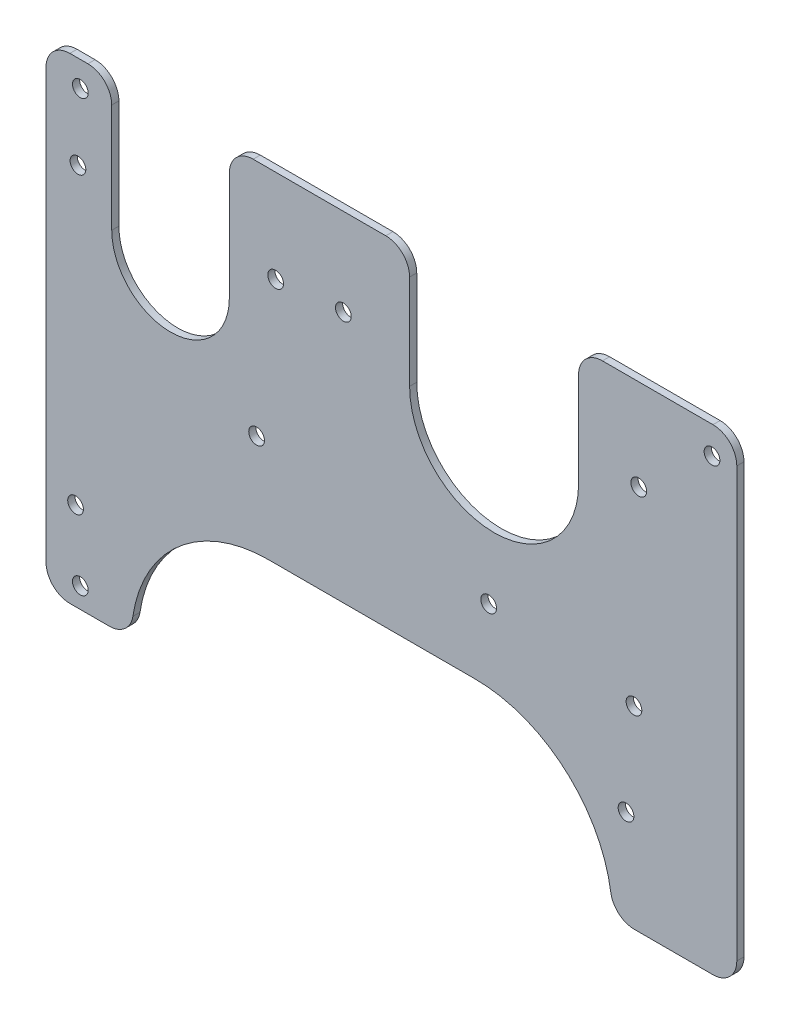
ISO-10303-21;
HEADER;
FILE_DESCRIPTION(('STEP AP214'),'2;1');
FILE_NAME('part.step','',(''),(''),'','','');
FILE_SCHEMA(('AUTOMOTIVE_DESIGN { 1 0 10303 214 1 1 1 1 }'));
ENDSEC;
DATA;
#1=APPLICATION_CONTEXT('core data for automotive mechanical design processes');
#2=APPLICATION_PROTOCOL_DEFINITION('international standard','automotive_design',2000,#1);
#3=PRODUCT_CONTEXT('',#1,'mechanical');
#4=PRODUCT('Part','Part','',(#3));
#5=PRODUCT_RELATED_PRODUCT_CATEGORY('part','',(#4));
#6=PRODUCT_DEFINITION_FORMATION('','',#4);
#7=PRODUCT_DEFINITION_CONTEXT('part definition',#1,'design');
#8=PRODUCT_DEFINITION('design','',#6,#7);
#9=PRODUCT_DEFINITION_SHAPE('','',#8);
#10=(LENGTH_UNIT() NAMED_UNIT(*) SI_UNIT(.MILLI.,.METRE.));
#11=(NAMED_UNIT(*) PLANE_ANGLE_UNIT() SI_UNIT($,.RADIAN.));
#12=(NAMED_UNIT(*) SI_UNIT($,.STERADIAN.) SOLID_ANGLE_UNIT());
#13=UNCERTAINTY_MEASURE_WITH_UNIT(LENGTH_MEASURE(1.E-05),#10,'distance_accuracy_value','');
#14=(GEOMETRIC_REPRESENTATION_CONTEXT(3) GLOBAL_UNCERTAINTY_ASSIGNED_CONTEXT((#13)) GLOBAL_UNIT_ASSIGNED_CONTEXT((#10,
#11,#12)) REPRESENTATION_CONTEXT('',''));
#15=CARTESIAN_POINT('',(0.,0.,0.));
#16=DIRECTION('',(0.,0.,1.));
#17=DIRECTION('',(1.,0.,0.));
#18=AXIS2_PLACEMENT_3D('',#15,#16,#17);
#19=CARTESIAN_POINT('',(-30.5832198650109,-25.4090195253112,1.5));
#20=DIRECTION('',(0.,1.,0.));
#21=DIRECTION('',(0.,0.,1.));
#22=AXIS2_PLACEMENT_3D('',#19,#20,#21);
#23=PLANE('',#22);
#24=DIRECTION('',(1.,0.,0.));
#25=VECTOR('',#24,1.);
#26=CARTESIAN_POINT('',(-30.5832198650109,-25.4090195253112,1.5));
#27=LINE('',#26,#25);
#28=CARTESIAN_POINT('',(-25.5832198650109,-25.4090195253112,1.5));
#29=VERTEX_POINT('',#28);
#30=CARTESIAN_POINT('',(-17.3053081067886,-25.4090195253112,1.5));
#31=VERTEX_POINT('',#30);
#32=EDGE_CURVE('E366',#29,#31,#27,.T.);
#33=ORIENTED_EDGE('',*,*,#32,.F.);
#34=DIRECTION('',(0.,0.,-1.));
#35=VECTOR('',#34,1.);
#36=CARTESIAN_POINT('',(-25.5832198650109,-25.4090195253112,1.5));
#37=LINE('',#36,#35);
#38=CARTESIAN_POINT('',(-25.5832198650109,-25.4090195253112,0.));
#39=VERTEX_POINT('',#38);
#40=EDGE_CURVE('E391',#29,#39,#37,.T.);
#41=ORIENTED_EDGE('',*,*,#40,.T.);
#42=DIRECTION('',(1.,0.,0.));
#43=VECTOR('',#42,1.);
#44=CARTESIAN_POINT('',(-30.5832198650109,-25.4090195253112,0.));
#45=LINE('',#44,#43);
#46=CARTESIAN_POINT('',(-17.3053081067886,-25.4090195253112,0.));
#47=VERTEX_POINT('',#46);
#48=EDGE_CURVE('E379',#39,#47,#45,.T.);
#49=ORIENTED_EDGE('',*,*,#48,.T.);
#50=DIRECTION('',(0.,0.,1.));
#51=VECTOR('',#50,1.);
#52=CARTESIAN_POINT('',(-17.3053081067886,-25.4090195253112,1.5));
#53=LINE('',#52,#51);
#54=EDGE_CURVE('E388',#47,#31,#53,.T.);
#55=ORIENTED_EDGE('',*,*,#54,.T.);
#56=EDGE_LOOP('',(#33,#41,#49,#55));
#57=FACE_BOUND('',#56,.T.);
#58=ADVANCED_FACE('F38',(#57),#23,.F.);
#59=CARTESIAN_POINT('',(-30.5832198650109,74.5909804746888,1.5));
#60=DIRECTION('',(0.,-1.,0.));
#61=DIRECTION('',(0.,0.,-1.));
#62=AXIS2_PLACEMENT_3D('',#59,#60,#61);
#63=PLANE('',#62);
#64=DIRECTION('',(-1.,0.,0.));
#65=VECTOR('',#64,1.);
#66=CARTESIAN_POINT('',(-30.5832198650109,74.5909804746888,1.5));
#67=LINE('',#66,#65);
#68=CARTESIAN_POINT('',(40.7330573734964,74.5909804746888,1.5));
#69=VERTEX_POINT('',#68);
#70=CARTESIAN_POINT('',(12.8917384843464,74.5909804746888,1.5));
#71=VERTEX_POINT('',#70);
#72=EDGE_CURVE('E372',#69,#71,#67,.T.);
#73=ORIENTED_EDGE('',*,*,#72,.F.);
#74=DIRECTION('',(0.,0.,1.));
#75=VECTOR('',#74,1.);
#76=CARTESIAN_POINT('',(40.7330573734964,74.5909804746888,1.5));
#77=LINE('',#76,#75);
#78=CARTESIAN_POINT('',(40.7330573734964,74.5909804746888,0.));
#79=VERTEX_POINT('',#78);
#80=EDGE_CURVE('E465',#69,#79,#77,.F.);
#81=ORIENTED_EDGE('',*,*,#80,.T.);
#82=DIRECTION('',(-1.,0.,0.));
#83=VECTOR('',#82,1.);
#84=CARTESIAN_POINT('',(-30.5832198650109,74.5909804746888,0.));
#85=LINE('',#84,#83);
#86=CARTESIAN_POINT('',(12.8917384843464,74.5909804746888,0.));
#87=VERTEX_POINT('',#86);
#88=EDGE_CURVE('E386',#79,#87,#85,.T.);
#89=ORIENTED_EDGE('',*,*,#88,.T.);
#90=DIRECTION('',(0.,0.,1.));
#91=VECTOR('',#90,1.);
#92=CARTESIAN_POINT('',(12.8917384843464,74.5909804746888,1.5));
#93=LINE('',#92,#91);
#94=EDGE_CURVE('E462',#87,#71,#93,.T.);
#95=ORIENTED_EDGE('',*,*,#94,.T.);
#96=EDGE_LOOP('',(#73,#81,#89,#95));
#97=FACE_BOUND('',#96,.T.);
#98=ADVANCED_FACE('F522',(#97),#63,.F.);
#99=CARTESIAN_POINT('',(-21.7917392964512,74.5909804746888,1.5));
#100=VERTEX_POINT('',#99);
#101=CARTESIAN_POINT('',(-25.5832198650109,74.5909804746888,1.5));
#102=VERTEX_POINT('',#101);
#103=EDGE_CURVE('E370',#100,#102,#67,.T.);
#104=ORIENTED_EDGE('',*,*,#103,.F.);
#105=DIRECTION('',(0.,0.,1.));
#106=VECTOR('',#105,1.);
#107=CARTESIAN_POINT('',(-21.7917392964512,74.5909804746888,1.5));
#108=LINE('',#107,#106);
#109=CARTESIAN_POINT('',(-21.7917392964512,74.5909804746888,0.));
#110=VERTEX_POINT('',#109);
#111=EDGE_CURVE('E11',#100,#110,#108,.F.);
#112=ORIENTED_EDGE('',*,*,#111,.T.);
#113=CARTESIAN_POINT('',(-25.5832198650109,74.5909804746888,0.));
#114=VERTEX_POINT('',#113);
#115=EDGE_CURVE('E383',#110,#114,#85,.T.);
#116=ORIENTED_EDGE('',*,*,#115,.T.);
#117=DIRECTION('',(0.,0.,-1.));
#118=VECTOR('',#117,1.);
#119=CARTESIAN_POINT('',(-25.5832198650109,74.5909804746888,1.5));
#120=LINE('',#119,#118);
#121=EDGE_CURVE('E46',#114,#102,#120,.F.);
#122=ORIENTED_EDGE('',*,*,#121,.T.);
#123=EDGE_LOOP('',(#104,#112,#116,#122));
#124=FACE_BOUND('',#123,.T.);
#125=ADVANCED_FACE('F490',(#124),#63,.F.);
#126=CARTESIAN_POINT('',(-30.5832198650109,74.5909804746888,1.5));
#127=DIRECTION('',(1.,0.,0.));
#128=DIRECTION('',(0.,1.,0.));
#129=AXIS2_PLACEMENT_3D('',#126,#127,#128);
#130=PLANE('',#129);
#131=DIRECTION('',(0.,-1.,0.));
#132=VECTOR('',#131,1.);
#133=CARTESIAN_POINT('',(-30.5832198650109,74.5909804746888,0.));
#134=LINE('',#133,#132);
#135=CARTESIAN_POINT('',(-30.5832198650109,69.5909804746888,0.));
#136=VERTEX_POINT('',#135);
#137=CARTESIAN_POINT('',(-30.5832198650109,-20.4090195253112,0.));
#138=VERTEX_POINT('',#137);
#139=EDGE_CURVE('E356',#136,#138,#134,.T.);
#140=ORIENTED_EDGE('',*,*,#139,.T.);
#141=DIRECTION('',(0.,0.,-1.));
#142=VECTOR('',#141,1.);
#143=CARTESIAN_POINT('',(-30.5832198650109,-20.4090195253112,1.5));
#144=LINE('',#143,#142);
#145=CARTESIAN_POINT('',(-30.5832198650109,-20.4090195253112,1.5));
#146=VERTEX_POINT('',#145);
#147=EDGE_CURVE('E417',#138,#146,#144,.F.);
#148=ORIENTED_EDGE('',*,*,#147,.T.);
#149=DIRECTION('',(0.,-1.,0.));
#150=VECTOR('',#149,1.);
#151=CARTESIAN_POINT('',(-30.5832198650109,74.5909804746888,1.5));
#152=LINE('',#151,#150);
#153=CARTESIAN_POINT('',(-30.5832198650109,69.5909804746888,1.5));
#154=VERTEX_POINT('',#153);
#155=EDGE_CURVE('E359',#154,#146,#152,.T.);
#156=ORIENTED_EDGE('',*,*,#155,.F.);
#157=DIRECTION('',(0.,0.,-1.));
#158=VECTOR('',#157,1.);
#159=CARTESIAN_POINT('',(-30.5832198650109,69.5909804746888,1.5));
#160=LINE('',#159,#158);
#161=EDGE_CURVE('E414',#154,#136,#160,.T.);
#162=ORIENTED_EDGE('',*,*,#161,.T.);
#163=EDGE_LOOP('',(#140,#148,#156,#162));
#164=FACE_BOUND('',#163,.T.);
#165=ADVANCED_FACE('F497',(#164),#130,.F.);
#166=CARTESIAN_POINT('',(92.9125711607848,-25.4090195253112,1.5));
#167=VERTEX_POINT('',#166);
#168=CARTESIAN_POINT('',(109.416780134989,-25.4090195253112,1.5));
#169=VERTEX_POINT('',#168);
#170=EDGE_CURVE('E362',#167,#169,#27,.T.);
#171=ORIENTED_EDGE('',*,*,#170,.F.);
#172=DIRECTION('',(0.,0.,1.));
#173=VECTOR('',#172,1.);
#174=CARTESIAN_POINT('',(92.9125711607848,-25.4090195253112,1.5));
#175=LINE('',#174,#173);
#176=CARTESIAN_POINT('',(92.9125711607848,-25.4090195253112,0.));
#177=VERTEX_POINT('',#176);
#178=EDGE_CURVE('E441',#167,#177,#175,.F.);
#179=ORIENTED_EDGE('',*,*,#178,.T.);
#180=CARTESIAN_POINT('',(109.416780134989,-25.4090195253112,0.));
#181=VERTEX_POINT('',#180);
#182=EDGE_CURVE('E376',#177,#181,#45,.T.);
#183=ORIENTED_EDGE('',*,*,#182,.T.);
#184=DIRECTION('',(0.,0.,-1.));
#185=VECTOR('',#184,1.);
#186=CARTESIAN_POINT('',(109.416780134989,-25.4090195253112,1.5));
#187=LINE('',#186,#185);
#188=EDGE_CURVE('E439',#181,#169,#187,.F.);
#189=ORIENTED_EDGE('',*,*,#188,.T.);
#190=EDGE_LOOP('',(#171,#179,#183,#189));
#191=FACE_BOUND('',#190,.T.);
#192=ADVANCED_FACE('F524',(#191),#23,.F.);
#193=CARTESIAN_POINT('',(114.416780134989,74.5909804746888,1.5));
#194=DIRECTION('',(-1.,0.,0.));
#195=DIRECTION('',(0.,-1.,0.));
#196=AXIS2_PLACEMENT_3D('',#193,#194,#195);
#197=PLANE('',#196);
#198=DIRECTION('',(0.,1.,0.));
#199=VECTOR('',#198,1.);
#200=CARTESIAN_POINT('',(114.416780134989,74.5909804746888,1.5));
#201=LINE('',#200,#199);
#202=CARTESIAN_POINT('',(114.416780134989,-20.4090195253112,1.5));
#203=VERTEX_POINT('',#202);
#204=CARTESIAN_POINT('',(114.416780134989,69.5909804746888,1.5));
#205=VERTEX_POINT('',#204);
#206=EDGE_CURVE('E367',#203,#205,#201,.T.);
#207=ORIENTED_EDGE('',*,*,#206,.F.);
#208=DIRECTION('',(0.,0.,-1.));
#209=VECTOR('',#208,1.);
#210=CARTESIAN_POINT('',(114.416780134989,-20.4090195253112,1.5));
#211=LINE('',#210,#209);
#212=CARTESIAN_POINT('',(114.416780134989,-20.4090195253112,0.));
#213=VERTEX_POINT('',#212);
#214=EDGE_CURVE('E448',#203,#213,#211,.T.);
#215=ORIENTED_EDGE('',*,*,#214,.T.);
#216=DIRECTION('',(0.,1.,0.));
#217=VECTOR('',#216,1.);
#218=CARTESIAN_POINT('',(114.416780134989,74.5909804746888,0.));
#219=LINE('',#218,#217);
#220=CARTESIAN_POINT('',(114.416780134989,69.5909804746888,0.));
#221=VERTEX_POINT('',#220);
#222=EDGE_CURVE('E380',#213,#221,#219,.T.);
#223=ORIENTED_EDGE('',*,*,#222,.T.);
#224=DIRECTION('',(0.,0.,-1.));
#225=VECTOR('',#224,1.);
#226=CARTESIAN_POINT('',(114.416780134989,69.5909804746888,1.5));
#227=LINE('',#226,#225);
#228=EDGE_CURVE('E446',#221,#205,#227,.F.);
#229=ORIENTED_EDGE('',*,*,#228,.T.);
#230=EDGE_LOOP('',(#207,#215,#223,#229));
#231=FACE_BOUND('',#230,.T.);
#232=ADVANCED_FACE('F534',(#231),#197,.F.);
#233=CARTESIAN_POINT('',(109.416780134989,74.5909804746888,1.5));
#234=VERTEX_POINT('',#233);
#235=CARTESIAN_POINT('',(86.2053269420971,74.5909804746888,1.5));
#236=VERTEX_POINT('',#235);
#237=EDGE_CURVE('E373',#234,#236,#67,.T.);
#238=ORIENTED_EDGE('',*,*,#237,.F.);
#239=DIRECTION('',(0.,0.,-1.));
#240=VECTOR('',#239,1.);
#241=CARTESIAN_POINT('',(109.416780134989,74.5909804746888,1.5));
#242=LINE('',#241,#240);
#243=CARTESIAN_POINT('',(109.416780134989,74.5909804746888,0.));
#244=VERTEX_POINT('',#243);
#245=EDGE_CURVE('E454',#234,#244,#242,.T.);
#246=ORIENTED_EDGE('',*,*,#245,.T.);
#247=CARTESIAN_POINT('',(86.2053269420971,74.5909804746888,0.));
#248=VERTEX_POINT('',#247);
#249=EDGE_CURVE('E363',#244,#248,#85,.T.);
#250=ORIENTED_EDGE('',*,*,#249,.T.);
#251=DIRECTION('',(0.,0.,1.));
#252=VECTOR('',#251,1.);
#253=CARTESIAN_POINT('',(86.2053269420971,74.5909804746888,1.5));
#254=LINE('',#253,#252);
#255=EDGE_CURVE('E451',#248,#236,#254,.T.);
#256=ORIENTED_EDGE('',*,*,#255,.T.);
#257=EDGE_LOOP('',(#238,#246,#250,#256));
#258=FACE_BOUND('',#257,.T.);
#259=ADVANCED_FACE('F530',(#258),#63,.F.);
#260=CARTESIAN_POINT('',(0.,0.,1.5));
#261=DIRECTION('',(0.,0.,1.));
#262=DIRECTION('',(1.,0.,0.));
#263=AXIS2_PLACEMENT_3D('',#260,#261,#262);
#264=PLANE('',#263);
#265=ORIENTED_EDGE('',*,*,#155,.T.);
#266=CARTESIAN_POINT('',(-25.5832198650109,-20.4090195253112,1.5));
#267=DIRECTION('',(0.,0.,1.));
#268=DIRECTION('',(1.,0.,0.));
#269=AXIS2_PLACEMENT_3D('',#266,#267,#268);
#270=CIRCLE('',#269,5.);
#271=EDGE_CURVE('E436',#146,#29,#270,.T.);
#272=ORIENTED_EDGE('',*,*,#271,.T.);
#273=ORIENTED_EDGE('',*,*,#32,.T.);
#274=CARTESIAN_POINT('',(-17.3053081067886,-20.4090195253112,1.5));
#275=DIRECTION('',(0.,0.,1.));
#276=DIRECTION('',(1.,0.,0.));
#277=AXIS2_PLACEMENT_3D('',#274,#275,#276);
#278=CIRCLE('',#277,5.);
#279=CARTESIAN_POINT('',(-12.3602982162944,-21.1485309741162,1.5));
#280=VERTEX_POINT('',#279);
#281=EDGE_CURVE('E434',#31,#280,#278,.T.);
#282=ORIENTED_EDGE('',*,*,#281,.T.);
#283=CARTESIAN_POINT('',(16.1289943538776,-25.4090195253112,1.5));
#284=DIRECTION('',(0.,0.,1.));
#285=DIRECTION('',(1.,0.,0.));
#286=AXIS2_PLACEMENT_3D('',#283,#284,#285);
#287=CIRCLE('',#286,28.8061027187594);
#288=CARTESIAN_POINT('',(16.1289943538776,3.39708319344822,1.5));
#289=VERTEX_POINT('',#288);
#290=EDGE_CURVE('E240',#289,#280,#287,.T.);
#291=ORIENTED_EDGE('',*,*,#290,.F.);
#292=DIRECTION('',(-1.,0.,0.));
#293=VECTOR('',#292,1.);
#294=CARTESIAN_POINT('',(16.1289943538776,3.39708319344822,1.5));
#295=LINE('',#294,#293);
#296=CARTESIAN_POINT('',(59.4782687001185,3.39708319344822,1.5));
#297=VERTEX_POINT('',#296);
#298=EDGE_CURVE('E218',#297,#289,#295,.T.);
#299=ORIENTED_EDGE('',*,*,#298,.F.);
#300=CARTESIAN_POINT('',(59.4782687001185,-25.4090195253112,1.5));
#301=DIRECTION('',(0.,0.,1.));
#302=DIRECTION('',(1.,0.,0.));
#303=AXIS2_PLACEMENT_3D('',#300,#301,#302);
#304=CIRCLE('',#303,28.8061027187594);
#305=CARTESIAN_POINT('',(87.9675612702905,-21.1485309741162,1.5));
#306=VERTEX_POINT('',#305);
#307=EDGE_CURVE('E242',#306,#297,#304,.T.);
#308=ORIENTED_EDGE('',*,*,#307,.F.);
#309=CARTESIAN_POINT('',(92.9125711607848,-20.4090195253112,1.5));
#310=DIRECTION('',(0.,0.,1.));
#311=DIRECTION('',(1.,0.,0.));
#312=AXIS2_PLACEMENT_3D('',#309,#310,#311);
#313=CIRCLE('',#312,5.);
#314=EDGE_CURVE('E432',#306,#167,#313,.T.);
#315=ORIENTED_EDGE('',*,*,#314,.T.);
#316=ORIENTED_EDGE('',*,*,#170,.T.);
#317=CARTESIAN_POINT('',(109.416780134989,-20.4090195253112,1.5));
#318=DIRECTION('',(0.,0.,1.));
#319=DIRECTION('',(1.,0.,0.));
#320=AXIS2_PLACEMENT_3D('',#317,#318,#319);
#321=CIRCLE('',#320,5.);
#322=EDGE_CURVE('E430',#169,#203,#321,.T.);
#323=ORIENTED_EDGE('',*,*,#322,.T.);
#324=ORIENTED_EDGE('',*,*,#206,.T.);
#325=CARTESIAN_POINT('',(109.416780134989,69.5909804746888,1.5));
#326=DIRECTION('',(0.,0.,1.));
#327=DIRECTION('',(1.,0.,0.));
#328=AXIS2_PLACEMENT_3D('',#325,#326,#327);
#329=CIRCLE('',#328,5.);
#330=EDGE_CURVE('E428',#205,#234,#329,.T.);
#331=ORIENTED_EDGE('',*,*,#330,.T.);
#332=ORIENTED_EDGE('',*,*,#237,.T.);
#333=CARTESIAN_POINT('',(86.2053269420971,69.5909804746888,1.5));
#334=DIRECTION('',(0.,0.,1.));
#335=DIRECTION('',(1.,0.,0.));
#336=AXIS2_PLACEMENT_3D('',#333,#334,#335);
#337=CIRCLE('',#336,5.);
#338=CARTESIAN_POINT('',(81.2053269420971,69.5909804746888,1.5));
#339=VERTEX_POINT('',#338);
#340=EDGE_CURVE('E426',#236,#339,#337,.T.);
#341=ORIENTED_EDGE('',*,*,#340,.T.);
#342=DIRECTION('',(0.,1.,0.));
#343=VECTOR('',#342,1.);
#344=CARTESIAN_POINT('',(81.2053269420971,49.7198506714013,1.5));
#345=LINE('',#344,#343);
#346=CARTESIAN_POINT('',(81.2053269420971,49.7198506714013,1.5));
#347=VERTEX_POINT('',#346);
#348=EDGE_CURVE('E257',#347,#339,#345,.T.);
#349=ORIENTED_EDGE('',*,*,#348,.F.);
#350=CARTESIAN_POINT('',(63.4691921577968,49.7198506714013,1.5));
#351=DIRECTION('',(0.,0.,1.));
#352=DIRECTION('',(1.,0.,0.));
#353=AXIS2_PLACEMENT_3D('',#350,#351,#352);
#354=CIRCLE('',#353,17.7361347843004);
#355=CARTESIAN_POINT('',(45.7330573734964,49.7198506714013,1.5));
#356=VERTEX_POINT('',#355);
#357=EDGE_CURVE('E222',#356,#347,#354,.T.);
#358=ORIENTED_EDGE('',*,*,#357,.F.);
#359=DIRECTION('',(0.,-1.,0.));
#360=VECTOR('',#359,1.);
#361=CARTESIAN_POINT('',(45.7330573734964,49.7198506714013,1.5));
#362=LINE('',#361,#360);
#363=CARTESIAN_POINT('',(45.7330573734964,69.5909804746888,1.5));
#364=VERTEX_POINT('',#363);
#365=EDGE_CURVE('E249',#364,#356,#362,.T.);
#366=ORIENTED_EDGE('',*,*,#365,.F.);
#367=CARTESIAN_POINT('',(40.7330573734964,69.5909804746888,1.5));
#368=DIRECTION('',(0.,0.,1.));
#369=DIRECTION('',(1.,0.,0.));
#370=AXIS2_PLACEMENT_3D('',#367,#368,#369);
#371=CIRCLE('',#370,5.);
#372=EDGE_CURVE('E424',#364,#69,#371,.T.);
#373=ORIENTED_EDGE('',*,*,#372,.T.);
#374=ORIENTED_EDGE('',*,*,#72,.T.);
#375=CARTESIAN_POINT('',(12.8917384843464,69.5909804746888,1.5));
#376=DIRECTION('',(0.,0.,1.));
#377=DIRECTION('',(1.,0.,0.));
#378=AXIS2_PLACEMENT_3D('',#375,#376,#377);
#379=CIRCLE('',#378,5.);
#380=CARTESIAN_POINT('',(7.89173848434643,69.5909804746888,1.5));
#381=VERTEX_POINT('',#380);
#382=EDGE_CURVE('E422',#71,#381,#379,.T.);
#383=ORIENTED_EDGE('',*,*,#382,.T.);
#384=DIRECTION('',(0.,1.,0.));
#385=VECTOR('',#384,1.);
#386=CARTESIAN_POINT('',(7.89173848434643,46.8277647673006,1.5));
#387=LINE('',#386,#385);
#388=CARTESIAN_POINT('',(7.89173848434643,46.8277647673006,1.5));
#389=VERTEX_POINT('',#388);
#390=EDGE_CURVE('E278',#389,#381,#387,.T.);
#391=ORIENTED_EDGE('',*,*,#390,.F.);
#392=CARTESIAN_POINT('',(-4.45000040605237,46.8277647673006,1.5));
#393=DIRECTION('',(0.,0.,1.));
#394=DIRECTION('',(1.,0.,0.));
#395=AXIS2_PLACEMENT_3D('',#392,#393,#394);
#396=CIRCLE('',#395,12.3417388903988);
#397=CARTESIAN_POINT('',(-16.7917392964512,46.8277647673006,1.5));
#398=VERTEX_POINT('',#397);
#399=EDGE_CURVE('E264',#398,#389,#396,.T.);
#400=ORIENTED_EDGE('',*,*,#399,.F.);
#401=DIRECTION('',(0.,-1.,0.));
#402=VECTOR('',#401,1.);
#403=CARTESIAN_POINT('',(-16.7917392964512,46.8277647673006,1.5));
#404=LINE('',#403,#402);
#405=CARTESIAN_POINT('',(-16.7917392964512,69.5909804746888,1.5));
#406=VERTEX_POINT('',#405);
#407=EDGE_CURVE('E270',#406,#398,#404,.T.);
#408=ORIENTED_EDGE('',*,*,#407,.F.);
#409=CARTESIAN_POINT('',(-21.7917392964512,69.5909804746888,1.5));
#410=DIRECTION('',(0.,0.,1.));
#411=DIRECTION('',(1.,0.,0.));
#412=AXIS2_PLACEMENT_3D('',#409,#410,#411);
#413=CIRCLE('',#412,5.);
#414=EDGE_CURVE('E59',#406,#100,#413,.T.);
#415=ORIENTED_EDGE('',*,*,#414,.T.);
#416=ORIENTED_EDGE('',*,*,#103,.T.);
#417=CARTESIAN_POINT('',(-25.5832198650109,69.5909804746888,1.5));
#418=DIRECTION('',(0.,0.,1.));
#419=DIRECTION('',(1.,0.,0.));
#420=AXIS2_PLACEMENT_3D('',#417,#418,#419);
#421=CIRCLE('',#420,5.);
#422=EDGE_CURVE('E419',#102,#154,#421,.T.);
#423=ORIENTED_EDGE('',*,*,#422,.T.);
#424=EDGE_LOOP('',(#265,#272,#273,#282,#291,#299,#308,#315,#316,#323,#324,#331,#332,#341,#349,
#358,#366,#373,#374,#383,#391,#400,#408,#415,#416,#423));
#425=FACE_BOUND('',#424,.T.);
#426=CARTESIAN_POINT('',(92.8292722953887,15.1679548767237,1.5));
#427=DIRECTION('',(0.,0.,-1.));
#428=DIRECTION('',(-1.,0.,0.));
#429=AXIS2_PLACEMENT_3D('',#426,#427,#428);
#430=CIRCLE('',#429,1.65);
#431=CARTESIAN_POINT('',(91.1792722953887,15.1679548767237,1.5));
#432=VERTEX_POINT('',#431);
#433=EDGE_CURVE('E287',#432,#432,#430,.T.);
#434=ORIENTED_EDGE('',*,*,#433,.T.);
#435=EDGE_LOOP('',(#434));
#436=FACE_BOUND('',#435,.T.);
#437=CARTESIAN_POINT('',(93.8292722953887,55.4679548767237,1.5));
#438=DIRECTION('',(0.,0.,-1.));
#439=DIRECTION('',(-1.,0.,0.));
#440=AXIS2_PLACEMENT_3D('',#437,#438,#439);
#441=CIRCLE('',#440,1.65);
#442=CARTESIAN_POINT('',(92.1792722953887,55.4679548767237,1.5));
#443=VERTEX_POINT('',#442);
#444=EDGE_CURVE('E293',#443,#443,#441,.T.);
#445=ORIENTED_EDGE('',*,*,#444,.T.);
#446=EDGE_LOOP('',(#445));
#447=FACE_BOUND('',#446,.T.);
#448=CARTESIAN_POINT('',(62.3292722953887,18.4679548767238,1.5));
#449=DIRECTION('',(0.,0.,-1.));
#450=DIRECTION('',(-1.,0.,0.));
#451=AXIS2_PLACEMENT_3D('',#448,#449,#450);
#452=CIRCLE('',#451,1.65);
#453=CARTESIAN_POINT('',(60.6792722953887,18.4679548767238,1.5));
#454=VERTEX_POINT('',#453);
#455=EDGE_CURVE('E299',#454,#454,#452,.T.);
#456=ORIENTED_EDGE('',*,*,#455,.T.);
#457=EDGE_LOOP('',(#456));
#458=FACE_BOUND('',#457,.T.);
#459=CARTESIAN_POINT('',(31.8292722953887,56.2679548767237,1.5));
#460=DIRECTION('',(0.,0.,-1.));
#461=DIRECTION('',(-1.,0.,0.));
#462=AXIS2_PLACEMENT_3D('',#459,#460,#461);
#463=CIRCLE('',#462,1.65);
#464=CARTESIAN_POINT('',(30.1792722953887,56.2679548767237,1.5));
#465=VERTEX_POINT('',#464);
#466=EDGE_CURVE('E305',#465,#465,#463,.T.);
#467=ORIENTED_EDGE('',*,*,#466,.T.);
#468=EDGE_LOOP('',(#467));
#469=FACE_BOUND('',#468,.T.);
#470=CARTESIAN_POINT('',(-24.3855963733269,-6.88312802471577,1.5));
#471=DIRECTION('',(0.,0.,-1.));
#472=DIRECTION('',(-1.,0.,0.));
#473=AXIS2_PLACEMENT_3D('',#470,#471,#472);
#474=CIRCLE('',#473,1.65);
#475=CARTESIAN_POINT('',(-26.0355963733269,-6.88312802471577,1.5));
#476=VERTEX_POINT('',#475);
#477=EDGE_CURVE('E311',#476,#476,#474,.T.);
#478=ORIENTED_EDGE('',*,*,#477,.T.);
#479=EDGE_LOOP('',(#478));
#480=FACE_BOUND('',#479,.T.);
#481=CARTESIAN_POINT('',(-23.8855963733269,55.1168719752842,1.5));
#482=DIRECTION('',(0.,0.,-1.));
#483=DIRECTION('',(-1.,0.,0.));
#484=AXIS2_PLACEMENT_3D('',#481,#482,#483);
#485=CIRCLE('',#484,1.65);
#486=CARTESIAN_POINT('',(-25.5355963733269,55.1168719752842,1.5));
#487=VERTEX_POINT('',#486);
#488=EDGE_CURVE('E317',#487,#487,#485,.T.);
#489=ORIENTED_EDGE('',*,*,#488,.T.);
#490=EDGE_LOOP('',(#489));
#491=FACE_BOUND('',#490,.T.);
#492=CARTESIAN_POINT('',(13.6144036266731,24.6168719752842,1.5));
#493=DIRECTION('',(0.,0.,-1.));
#494=DIRECTION('',(-1.,0.,0.));
#495=AXIS2_PLACEMENT_3D('',#492,#493,#494);
#496=CIRCLE('',#495,1.65);
#497=CARTESIAN_POINT('',(11.9644036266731,24.6168719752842,1.5));
#498=VERTEX_POINT('',#497);
#499=EDGE_CURVE('E323',#498,#498,#496,.T.);
#500=ORIENTED_EDGE('',*,*,#499,.T.);
#501=EDGE_LOOP('',(#500));
#502=FACE_BOUND('',#501,.T.);
#503=CARTESIAN_POINT('',(17.6144036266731,55.1168719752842,1.5));
#504=DIRECTION('',(0.,0.,-1.));
#505=DIRECTION('',(-1.,0.,0.));
#506=AXIS2_PLACEMENT_3D('',#503,#504,#505);
#507=CIRCLE('',#506,1.65);
#508=CARTESIAN_POINT('',(15.9644036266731,55.1168719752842,1.5));
#509=VERTEX_POINT('',#508);
#510=EDGE_CURVE('E329',#509,#509,#507,.T.);
#511=ORIENTED_EDGE('',*,*,#510,.T.);
#512=EDGE_LOOP('',(#511));
#513=FACE_BOUND('',#512,.T.);
#514=CARTESIAN_POINT('',(109.21134972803,68.7909804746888,1.5));
#515=DIRECTION('',(0.,0.,-1.));
#516=DIRECTION('',(-1.,0.,0.));
#517=AXIS2_PLACEMENT_3D('',#514,#515,#516);
#518=CIRCLE('',#517,1.65);
#519=CARTESIAN_POINT('',(107.56134972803,68.7909804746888,1.5));
#520=VERTEX_POINT('',#519);
#521=EDGE_CURVE('E335',#520,#520,#518,.T.);
#522=ORIENTED_EDGE('',*,*,#521,.T.);
#523=EDGE_LOOP('',(#522));
#524=FACE_BOUND('',#523,.T.);
#525=CARTESIAN_POINT('',(91.1613497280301,-4.95901952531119,1.5));
#526=DIRECTION('',(0.,0.,-1.));
#527=DIRECTION('',(-1.,0.,0.));
#528=AXIS2_PLACEMENT_3D('',#525,#526,#527);
#529=CIRCLE('',#528,1.65);
#530=CARTESIAN_POINT('',(89.5113497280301,-4.95901952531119,1.5));
#531=VERTEX_POINT('',#530);
#532=EDGE_CURVE('E341',#531,#531,#529,.T.);
#533=ORIENTED_EDGE('',*,*,#532,.T.);
#534=EDGE_LOOP('',(#533));
#535=FACE_BOUND('',#534,.T.);
#536=CARTESIAN_POINT('',(-23.3886502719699,69.2909804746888,1.5));
#537=DIRECTION('',(0.,0.,-1.));
#538=DIRECTION('',(-1.,0.,0.));
#539=AXIS2_PLACEMENT_3D('',#536,#537,#538);
#540=CIRCLE('',#539,1.65);
#541=CARTESIAN_POINT('',(-25.0386502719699,69.2909804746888,1.5));
#542=VERTEX_POINT('',#541);
#543=EDGE_CURVE('E347',#542,#542,#540,.T.);
#544=ORIENTED_EDGE('',*,*,#543,.T.);
#545=EDGE_LOOP('',(#544));
#546=FACE_BOUND('',#545,.T.);
#547=CARTESIAN_POINT('',(-23.3886502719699,-21.1090195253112,1.5));
#548=DIRECTION('',(0.,0.,-1.));
#549=DIRECTION('',(-1.,0.,0.));
#550=AXIS2_PLACEMENT_3D('',#547,#548,#549);
#551=CIRCLE('',#550,1.65);
#552=CARTESIAN_POINT('',(-25.0386502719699,-21.1090195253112,1.5));
#553=VERTEX_POINT('',#552);
#554=EDGE_CURVE('E353',#553,#553,#551,.T.);
#555=ORIENTED_EDGE('',*,*,#554,.T.);
#556=EDGE_LOOP('',(#555));
#557=FACE_BOUND('',#556,.T.);
#558=ADVANCED_FACE('F479',(#425,#436,#447,#458,#469,#480,#491,#502,#513,#524,#535,#546,#557),
#264,.T.);
#559=CARTESIAN_POINT('',(0.,0.,0.));
#560=DIRECTION('',(0.,0.,1.));
#561=DIRECTION('',(1.,0.,0.));
#562=AXIS2_PLACEMENT_3D('',#559,#560,#561);
#563=PLANE('',#562);
#564=CARTESIAN_POINT('',(92.8292722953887,15.1679548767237,0.));
#565=DIRECTION('',(0.,0.,-1.));
#566=DIRECTION('',(-1.,0.,0.));
#567=AXIS2_PLACEMENT_3D('',#564,#565,#566);
#568=CIRCLE('',#567,1.65);
#569=CARTESIAN_POINT('',(91.1792722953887,15.1679548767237,0.));
#570=VERTEX_POINT('',#569);
#571=EDGE_CURVE('E285',#570,#570,#568,.T.);
#572=ORIENTED_EDGE('',*,*,#571,.F.);
#573=EDGE_LOOP('',(#572));
#574=FACE_BOUND('',#573,.T.);
#575=CARTESIAN_POINT('',(93.8292722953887,55.4679548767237,0.));
#576=DIRECTION('',(0.,0.,-1.));
#577=DIRECTION('',(-1.,0.,0.));
#578=AXIS2_PLACEMENT_3D('',#575,#576,#577);
#579=CIRCLE('',#578,1.65);
#580=CARTESIAN_POINT('',(92.1792722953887,55.4679548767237,0.));
#581=VERTEX_POINT('',#580);
#582=EDGE_CURVE('E290',#581,#581,#579,.T.);
#583=ORIENTED_EDGE('',*,*,#582,.F.);
#584=EDGE_LOOP('',(#583));
#585=FACE_BOUND('',#584,.T.);
#586=CARTESIAN_POINT('',(62.3292722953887,18.4679548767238,0.));
#587=DIRECTION('',(0.,0.,-1.));
#588=DIRECTION('',(-1.,0.,0.));
#589=AXIS2_PLACEMENT_3D('',#586,#587,#588);
#590=CIRCLE('',#589,1.65);
#591=CARTESIAN_POINT('',(60.6792722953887,18.4679548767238,0.));
#592=VERTEX_POINT('',#591);
#593=EDGE_CURVE('E296',#592,#592,#590,.T.);
#594=ORIENTED_EDGE('',*,*,#593,.F.);
#595=EDGE_LOOP('',(#594));
#596=FACE_BOUND('',#595,.T.);
#597=CARTESIAN_POINT('',(31.8292722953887,56.2679548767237,0.));
#598=DIRECTION('',(0.,0.,-1.));
#599=DIRECTION('',(-1.,0.,0.));
#600=AXIS2_PLACEMENT_3D('',#597,#598,#599);
#601=CIRCLE('',#600,1.65);
#602=CARTESIAN_POINT('',(30.1792722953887,56.2679548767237,0.));
#603=VERTEX_POINT('',#602);
#604=EDGE_CURVE('E302',#603,#603,#601,.T.);
#605=ORIENTED_EDGE('',*,*,#604,.F.);
#606=EDGE_LOOP('',(#605));
#607=FACE_BOUND('',#606,.T.);
#608=CARTESIAN_POINT('',(-24.3855963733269,-6.88312802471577,0.));
#609=DIRECTION('',(0.,0.,-1.));
#610=DIRECTION('',(-1.,0.,0.));
#611=AXIS2_PLACEMENT_3D('',#608,#609,#610);
#612=CIRCLE('',#611,1.65);
#613=CARTESIAN_POINT('',(-26.0355963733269,-6.88312802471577,0.));
#614=VERTEX_POINT('',#613);
#615=EDGE_CURVE('E308',#614,#614,#612,.T.);
#616=ORIENTED_EDGE('',*,*,#615,.F.);
#617=EDGE_LOOP('',(#616));
#618=FACE_BOUND('',#617,.T.);
#619=CARTESIAN_POINT('',(-23.8855963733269,55.1168719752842,0.));
#620=DIRECTION('',(0.,0.,-1.));
#621=DIRECTION('',(-1.,0.,0.));
#622=AXIS2_PLACEMENT_3D('',#619,#620,#621);
#623=CIRCLE('',#622,1.65);
#624=CARTESIAN_POINT('',(-25.5355963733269,55.1168719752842,0.));
#625=VERTEX_POINT('',#624);
#626=EDGE_CURVE('E314',#625,#625,#623,.T.);
#627=ORIENTED_EDGE('',*,*,#626,.F.);
#628=EDGE_LOOP('',(#627));
#629=FACE_BOUND('',#628,.T.);
#630=CARTESIAN_POINT('',(13.6144036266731,24.6168719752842,0.));
#631=DIRECTION('',(0.,0.,-1.));
#632=DIRECTION('',(-1.,0.,0.));
#633=AXIS2_PLACEMENT_3D('',#630,#631,#632);
#634=CIRCLE('',#633,1.65);
#635=CARTESIAN_POINT('',(11.9644036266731,24.6168719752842,0.));
#636=VERTEX_POINT('',#635);
#637=EDGE_CURVE('E320',#636,#636,#634,.T.);
#638=ORIENTED_EDGE('',*,*,#637,.F.);
#639=EDGE_LOOP('',(#638));
#640=FACE_BOUND('',#639,.T.);
#641=CARTESIAN_POINT('',(17.6144036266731,55.1168719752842,0.));
#642=DIRECTION('',(0.,0.,-1.));
#643=DIRECTION('',(-1.,0.,0.));
#644=AXIS2_PLACEMENT_3D('',#641,#642,#643);
#645=CIRCLE('',#644,1.65);
#646=CARTESIAN_POINT('',(15.9644036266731,55.1168719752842,0.));
#647=VERTEX_POINT('',#646);
#648=EDGE_CURVE('E326',#647,#647,#645,.T.);
#649=ORIENTED_EDGE('',*,*,#648,.F.);
#650=EDGE_LOOP('',(#649));
#651=FACE_BOUND('',#650,.T.);
#652=CARTESIAN_POINT('',(109.21134972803,68.7909804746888,0.));
#653=DIRECTION('',(0.,0.,-1.));
#654=DIRECTION('',(-1.,0.,0.));
#655=AXIS2_PLACEMENT_3D('',#652,#653,#654);
#656=CIRCLE('',#655,1.65);
#657=CARTESIAN_POINT('',(107.56134972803,68.7909804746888,0.));
#658=VERTEX_POINT('',#657);
#659=EDGE_CURVE('E332',#658,#658,#656,.T.);
#660=ORIENTED_EDGE('',*,*,#659,.F.);
#661=EDGE_LOOP('',(#660));
#662=FACE_BOUND('',#661,.T.);
#663=CARTESIAN_POINT('',(91.1613497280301,-4.95901952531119,0.));
#664=DIRECTION('',(0.,0.,-1.));
#665=DIRECTION('',(-1.,0.,0.));
#666=AXIS2_PLACEMENT_3D('',#663,#664,#665);
#667=CIRCLE('',#666,1.65);
#668=CARTESIAN_POINT('',(89.5113497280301,-4.95901952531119,0.));
#669=VERTEX_POINT('',#668);
#670=EDGE_CURVE('E338',#669,#669,#667,.T.);
#671=ORIENTED_EDGE('',*,*,#670,.F.);
#672=EDGE_LOOP('',(#671));
#673=FACE_BOUND('',#672,.T.);
#674=CARTESIAN_POINT('',(-23.3886502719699,69.2909804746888,0.));
#675=DIRECTION('',(0.,0.,-1.));
#676=DIRECTION('',(-1.,0.,0.));
#677=AXIS2_PLACEMENT_3D('',#674,#675,#676);
#678=CIRCLE('',#677,1.65);
#679=CARTESIAN_POINT('',(-25.0386502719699,69.2909804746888,0.));
#680=VERTEX_POINT('',#679);
#681=EDGE_CURVE('E344',#680,#680,#678,.T.);
#682=ORIENTED_EDGE('',*,*,#681,.F.);
#683=EDGE_LOOP('',(#682));
#684=FACE_BOUND('',#683,.T.);
#685=CARTESIAN_POINT('',(-23.3886502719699,-21.1090195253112,0.));
#686=DIRECTION('',(0.,0.,-1.));
#687=DIRECTION('',(-1.,0.,0.));
#688=AXIS2_PLACEMENT_3D('',#685,#686,#687);
#689=CIRCLE('',#688,1.65);
#690=CARTESIAN_POINT('',(-25.0386502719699,-21.1090195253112,0.));
#691=VERTEX_POINT('',#690);
#692=EDGE_CURVE('E350',#691,#691,#689,.T.);
#693=ORIENTED_EDGE('',*,*,#692,.F.);
#694=EDGE_LOOP('',(#693));
#695=FACE_BOUND('',#694,.T.);
#696=ORIENTED_EDGE('',*,*,#48,.F.);
#697=CARTESIAN_POINT('',(-25.5832198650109,-20.4090195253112,0.));
#698=DIRECTION('',(0.,0.,1.));
#699=DIRECTION('',(1.,0.,0.));
#700=AXIS2_PLACEMENT_3D('',#697,#698,#699);
#701=CIRCLE('',#700,5.);
#702=EDGE_CURVE('E412',#39,#138,#701,.F.);
#703=ORIENTED_EDGE('',*,*,#702,.T.);
#704=ORIENTED_EDGE('',*,*,#139,.F.);
#705=CARTESIAN_POINT('',(-25.5832198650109,69.5909804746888,0.));
#706=DIRECTION('',(0.,0.,1.));
#707=DIRECTION('',(1.,0.,0.));
#708=AXIS2_PLACEMENT_3D('',#705,#706,#707);
#709=CIRCLE('',#708,5.);
#710=EDGE_CURVE('E394',#136,#114,#709,.F.);
#711=ORIENTED_EDGE('',*,*,#710,.T.);
#712=ORIENTED_EDGE('',*,*,#115,.F.);
#713=CARTESIAN_POINT('',(-21.7917392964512,69.5909804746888,0.));
#714=DIRECTION('',(0.,0.,1.));
#715=DIRECTION('',(1.,0.,0.));
#716=AXIS2_PLACEMENT_3D('',#713,#714,#715);
#717=CIRCLE('',#716,5.);
#718=CARTESIAN_POINT('',(-16.7917392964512,69.5909804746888,0.));
#719=VERTEX_POINT('',#718);
#720=EDGE_CURVE('E396',#110,#719,#717,.F.);
#721=ORIENTED_EDGE('',*,*,#720,.T.);
#722=DIRECTION('',(0.,-1.,0.));
#723=VECTOR('',#722,1.);
#724=CARTESIAN_POINT('',(-16.7917392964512,46.8277647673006,0.));
#725=LINE('',#724,#723);
#726=CARTESIAN_POINT('',(-16.7917392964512,46.8277647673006,0.));
#727=VERTEX_POINT('',#726);
#728=EDGE_CURVE('E273',#719,#727,#725,.T.);
#729=ORIENTED_EDGE('',*,*,#728,.T.);
#730=CARTESIAN_POINT('',(-4.45000040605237,46.8277647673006,0.));
#731=DIRECTION('',(0.,0.,1.));
#732=DIRECTION('',(1.,0.,0.));
#733=AXIS2_PLACEMENT_3D('',#730,#731,#732);
#734=CIRCLE('',#733,12.3417388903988);
#735=CARTESIAN_POINT('',(7.89173848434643,46.8277647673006,0.));
#736=VERTEX_POINT('',#735);
#737=EDGE_CURVE('E266',#727,#736,#734,.T.);
#738=ORIENTED_EDGE('',*,*,#737,.T.);
#739=DIRECTION('',(0.,1.,0.));
#740=VECTOR('',#739,1.);
#741=CARTESIAN_POINT('',(7.89173848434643,46.8277647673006,0.));
#742=LINE('',#741,#740);
#743=CARTESIAN_POINT('',(7.89173848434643,69.5909804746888,0.));
#744=VERTEX_POINT('',#743);
#745=EDGE_CURVE('E269',#736,#744,#742,.T.);
#746=ORIENTED_EDGE('',*,*,#745,.T.);
#747=CARTESIAN_POINT('',(12.8917384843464,69.5909804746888,0.));
#748=DIRECTION('',(0.,0.,1.));
#749=DIRECTION('',(1.,0.,0.));
#750=AXIS2_PLACEMENT_3D('',#747,#748,#749);
#751=CIRCLE('',#750,5.);
#752=EDGE_CURVE('E398',#744,#87,#751,.F.);
#753=ORIENTED_EDGE('',*,*,#752,.T.);
#754=ORIENTED_EDGE('',*,*,#88,.F.);
#755=CARTESIAN_POINT('',(40.7330573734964,69.5909804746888,0.));
#756=DIRECTION('',(0.,0.,1.));
#757=DIRECTION('',(1.,0.,0.));
#758=AXIS2_PLACEMENT_3D('',#755,#756,#757);
#759=CIRCLE('',#758,5.);
#760=CARTESIAN_POINT('',(45.7330573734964,69.5909804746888,0.));
#761=VERTEX_POINT('',#760);
#762=EDGE_CURVE('E400',#79,#761,#759,.F.);
#763=ORIENTED_EDGE('',*,*,#762,.T.);
#764=DIRECTION('',(0.,-1.,0.));
#765=VECTOR('',#764,1.);
#766=CARTESIAN_POINT('',(45.7330573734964,49.7198506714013,0.));
#767=LINE('',#766,#765);
#768=CARTESIAN_POINT('',(45.7330573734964,49.7198506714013,0.));
#769=VERTEX_POINT('',#768);
#770=EDGE_CURVE('E252',#761,#769,#767,.T.);
#771=ORIENTED_EDGE('',*,*,#770,.T.);
#772=CARTESIAN_POINT('',(63.4691921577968,49.7198506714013,0.));
#773=DIRECTION('',(0.,0.,1.));
#774=DIRECTION('',(1.,0.,0.));
#775=AXIS2_PLACEMENT_3D('',#772,#773,#774);
#776=CIRCLE('',#775,17.7361347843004);
#777=CARTESIAN_POINT('',(81.2053269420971,49.7198506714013,0.));
#778=VERTEX_POINT('',#777);
#779=EDGE_CURVE('E245',#769,#778,#776,.T.);
#780=ORIENTED_EDGE('',*,*,#779,.T.);
#781=DIRECTION('',(0.,1.,0.));
#782=VECTOR('',#781,1.);
#783=CARTESIAN_POINT('',(81.2053269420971,49.7198506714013,0.));
#784=LINE('',#783,#782);
#785=CARTESIAN_POINT('',(81.2053269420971,69.5909804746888,0.));
#786=VERTEX_POINT('',#785);
#787=EDGE_CURVE('E248',#778,#786,#784,.T.);
#788=ORIENTED_EDGE('',*,*,#787,.T.);
#789=CARTESIAN_POINT('',(86.2053269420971,69.5909804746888,0.));
#790=DIRECTION('',(0.,0.,1.));
#791=DIRECTION('',(1.,0.,0.));
#792=AXIS2_PLACEMENT_3D('',#789,#790,#791);
#793=CIRCLE('',#792,5.);
#794=EDGE_CURVE('E402',#786,#248,#793,.F.);
#795=ORIENTED_EDGE('',*,*,#794,.T.);
#796=ORIENTED_EDGE('',*,*,#249,.F.);
#797=CARTESIAN_POINT('',(109.416780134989,69.5909804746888,0.));
#798=DIRECTION('',(0.,0.,1.));
#799=DIRECTION('',(1.,0.,0.));
#800=AXIS2_PLACEMENT_3D('',#797,#798,#799);
#801=CIRCLE('',#800,5.);
#802=EDGE_CURVE('E404',#244,#221,#801,.F.);
#803=ORIENTED_EDGE('',*,*,#802,.T.);
#804=ORIENTED_EDGE('',*,*,#222,.F.);
#805=CARTESIAN_POINT('',(109.416780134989,-20.4090195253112,0.));
#806=DIRECTION('',(0.,0.,1.));
#807=DIRECTION('',(1.,0.,0.));
#808=AXIS2_PLACEMENT_3D('',#805,#806,#807);
#809=CIRCLE('',#808,5.);
#810=EDGE_CURVE('E406',#213,#181,#809,.F.);
#811=ORIENTED_EDGE('',*,*,#810,.T.);
#812=ORIENTED_EDGE('',*,*,#182,.F.);
#813=CARTESIAN_POINT('',(92.9125711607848,-20.4090195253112,0.));
#814=DIRECTION('',(0.,0.,1.));
#815=DIRECTION('',(1.,0.,0.));
#816=AXIS2_PLACEMENT_3D('',#813,#814,#815);
#817=CIRCLE('',#816,5.);
#818=CARTESIAN_POINT('',(87.9675612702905,-21.1485309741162,0.));
#819=VERTEX_POINT('',#818);
#820=EDGE_CURVE('E408',#177,#819,#817,.F.);
#821=ORIENTED_EDGE('',*,*,#820,.T.);
#822=CARTESIAN_POINT('',(59.4782687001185,-25.4090195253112,0.));
#823=DIRECTION('',(0.,0.,1.));
#824=DIRECTION('',(1.,0.,0.));
#825=AXIS2_PLACEMENT_3D('',#822,#823,#824);
#826=CIRCLE('',#825,28.8061027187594);
#827=CARTESIAN_POINT('',(59.4782687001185,3.39708319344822,0.));
#828=VERTEX_POINT('',#827);
#829=EDGE_CURVE('E236',#819,#828,#826,.T.);
#830=ORIENTED_EDGE('',*,*,#829,.T.);
#831=DIRECTION('',(-1.,0.,0.));
#832=VECTOR('',#831,1.);
#833=CARTESIAN_POINT('',(16.1289943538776,3.39708319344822,0.));
#834=LINE('',#833,#832);
#835=CARTESIAN_POINT('',(16.1289943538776,3.39708319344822,0.));
#836=VERTEX_POINT('',#835);
#837=EDGE_CURVE('E215',#828,#836,#834,.T.);
#838=ORIENTED_EDGE('',*,*,#837,.T.);
#839=CARTESIAN_POINT('',(16.1289943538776,-25.4090195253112,0.));
#840=DIRECTION('',(0.,0.,1.));
#841=DIRECTION('',(1.,0.,0.));
#842=AXIS2_PLACEMENT_3D('',#839,#840,#841);
#843=CIRCLE('',#842,28.8061027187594);
#844=CARTESIAN_POINT('',(-12.3602982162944,-21.1485309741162,0.));
#845=VERTEX_POINT('',#844);
#846=EDGE_CURVE('E226',#836,#845,#843,.T.);
#847=ORIENTED_EDGE('',*,*,#846,.T.);
#848=CARTESIAN_POINT('',(-17.3053081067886,-20.4090195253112,0.));
#849=DIRECTION('',(0.,0.,1.));
#850=DIRECTION('',(1.,0.,0.));
#851=AXIS2_PLACEMENT_3D('',#848,#849,#850);
#852=CIRCLE('',#851,5.);
#853=EDGE_CURVE('E410',#845,#47,#852,.F.);
#854=ORIENTED_EDGE('',*,*,#853,.T.);
#855=EDGE_LOOP('',(#696,#703,#704,#711,#712,#721,#729,#738,#746,#753,#754,#763,#771,#780,#788,
#795,#796,#803,#804,#811,#812,#821,#830,#838,#847,#854));
#856=FACE_BOUND('',#855,.T.);
#857=ADVANCED_FACE('F234',(#574,#585,#596,#607,#618,#629,#640,#651,#662,#673,#684,#695,#856),
#563,.F.);
#858=CARTESIAN_POINT('',(-23.3886502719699,-21.1090195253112,1.5));
#859=DIRECTION('',(0.,0.,-1.));
#860=DIRECTION('',(-1.,0.,0.));
#861=AXIS2_PLACEMENT_3D('',#858,#859,#860);
#862=CYLINDRICAL_SURFACE('',#861,1.65);
#863=ORIENTED_EDGE('',*,*,#554,.F.);
#864=EDGE_LOOP('',(#863));
#865=FACE_BOUND('',#864,.T.);
#866=ORIENTED_EDGE('',*,*,#692,.T.);
#867=EDGE_LOOP('',(#866));
#868=FACE_BOUND('',#867,.T.);
#869=ADVANCED_FACE('F623',(#865,#868),#862,.F.);
#870=CARTESIAN_POINT('',(-23.3886502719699,69.2909804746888,1.5));
#871=DIRECTION('',(0.,0.,-1.));
#872=DIRECTION('',(-1.,0.,0.));
#873=AXIS2_PLACEMENT_3D('',#870,#871,#872);
#874=CYLINDRICAL_SURFACE('',#873,1.65);
#875=ORIENTED_EDGE('',*,*,#543,.F.);
#876=EDGE_LOOP('',(#875));
#877=FACE_BOUND('',#876,.T.);
#878=ORIENTED_EDGE('',*,*,#681,.T.);
#879=EDGE_LOOP('',(#878));
#880=FACE_BOUND('',#879,.T.);
#881=ADVANCED_FACE('F619',(#877,#880),#874,.F.);
#882=CARTESIAN_POINT('',(91.1613497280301,-4.95901952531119,1.5));
#883=DIRECTION('',(0.,0.,-1.));
#884=DIRECTION('',(-1.,0.,0.));
#885=AXIS2_PLACEMENT_3D('',#882,#883,#884);
#886=CYLINDRICAL_SURFACE('',#885,1.65);
#887=ORIENTED_EDGE('',*,*,#532,.F.);
#888=EDGE_LOOP('',(#887));
#889=FACE_BOUND('',#888,.T.);
#890=ORIENTED_EDGE('',*,*,#670,.T.);
#891=EDGE_LOOP('',(#890));
#892=FACE_BOUND('',#891,.T.);
#893=ADVANCED_FACE('F615',(#889,#892),#886,.F.);
#894=CARTESIAN_POINT('',(109.21134972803,68.7909804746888,1.5));
#895=DIRECTION('',(0.,0.,-1.));
#896=DIRECTION('',(-1.,0.,0.));
#897=AXIS2_PLACEMENT_3D('',#894,#895,#896);
#898=CYLINDRICAL_SURFACE('',#897,1.65);
#899=ORIENTED_EDGE('',*,*,#521,.F.);
#900=EDGE_LOOP('',(#899));
#901=FACE_BOUND('',#900,.T.);
#902=ORIENTED_EDGE('',*,*,#659,.T.);
#903=EDGE_LOOP('',(#902));
#904=FACE_BOUND('',#903,.T.);
#905=ADVANCED_FACE('F611',(#901,#904),#898,.F.);
#906=CARTESIAN_POINT('',(17.6144036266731,55.1168719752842,1.5));
#907=DIRECTION('',(0.,0.,-1.));
#908=DIRECTION('',(-1.,0.,0.));
#909=AXIS2_PLACEMENT_3D('',#906,#907,#908);
#910=CYLINDRICAL_SURFACE('',#909,1.65);
#911=ORIENTED_EDGE('',*,*,#510,.F.);
#912=EDGE_LOOP('',(#911));
#913=FACE_BOUND('',#912,.T.);
#914=ORIENTED_EDGE('',*,*,#648,.T.);
#915=EDGE_LOOP('',(#914));
#916=FACE_BOUND('',#915,.T.);
#917=ADVANCED_FACE('F607',(#913,#916),#910,.F.);
#918=CARTESIAN_POINT('',(13.6144036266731,24.6168719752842,1.5));
#919=DIRECTION('',(0.,0.,-1.));
#920=DIRECTION('',(-1.,0.,0.));
#921=AXIS2_PLACEMENT_3D('',#918,#919,#920);
#922=CYLINDRICAL_SURFACE('',#921,1.65);
#923=ORIENTED_EDGE('',*,*,#499,.F.);
#924=EDGE_LOOP('',(#923));
#925=FACE_BOUND('',#924,.T.);
#926=ORIENTED_EDGE('',*,*,#637,.T.);
#927=EDGE_LOOP('',(#926));
#928=FACE_BOUND('',#927,.T.);
#929=ADVANCED_FACE('F603',(#925,#928),#922,.F.);
#930=CARTESIAN_POINT('',(-23.8855963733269,55.1168719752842,1.5));
#931=DIRECTION('',(0.,0.,-1.));
#932=DIRECTION('',(-1.,0.,0.));
#933=AXIS2_PLACEMENT_3D('',#930,#931,#932);
#934=CYLINDRICAL_SURFACE('',#933,1.65);
#935=ORIENTED_EDGE('',*,*,#488,.F.);
#936=EDGE_LOOP('',(#935));
#937=FACE_BOUND('',#936,.T.);
#938=ORIENTED_EDGE('',*,*,#626,.T.);
#939=EDGE_LOOP('',(#938));
#940=FACE_BOUND('',#939,.T.);
#941=ADVANCED_FACE('F599',(#937,#940),#934,.F.);
#942=CARTESIAN_POINT('',(-24.3855963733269,-6.88312802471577,1.5));
#943=DIRECTION('',(0.,0.,-1.));
#944=DIRECTION('',(-1.,0.,0.));
#945=AXIS2_PLACEMENT_3D('',#942,#943,#944);
#946=CYLINDRICAL_SURFACE('',#945,1.65);
#947=ORIENTED_EDGE('',*,*,#477,.F.);
#948=EDGE_LOOP('',(#947));
#949=FACE_BOUND('',#948,.T.);
#950=ORIENTED_EDGE('',*,*,#615,.T.);
#951=EDGE_LOOP('',(#950));
#952=FACE_BOUND('',#951,.T.);
#953=ADVANCED_FACE('F595',(#949,#952),#946,.F.);
#954=CARTESIAN_POINT('',(31.8292722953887,56.2679548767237,1.5));
#955=DIRECTION('',(0.,0.,-1.));
#956=DIRECTION('',(-1.,0.,0.));
#957=AXIS2_PLACEMENT_3D('',#954,#955,#956);
#958=CYLINDRICAL_SURFACE('',#957,1.65);
#959=ORIENTED_EDGE('',*,*,#466,.F.);
#960=EDGE_LOOP('',(#959));
#961=FACE_BOUND('',#960,.T.);
#962=ORIENTED_EDGE('',*,*,#604,.T.);
#963=EDGE_LOOP('',(#962));
#964=FACE_BOUND('',#963,.T.);
#965=ADVANCED_FACE('F591',(#961,#964),#958,.F.);
#966=CARTESIAN_POINT('',(62.3292722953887,18.4679548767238,1.5));
#967=DIRECTION('',(0.,0.,-1.));
#968=DIRECTION('',(-1.,0.,0.));
#969=AXIS2_PLACEMENT_3D('',#966,#967,#968);
#970=CYLINDRICAL_SURFACE('',#969,1.65);
#971=ORIENTED_EDGE('',*,*,#455,.F.);
#972=EDGE_LOOP('',(#971));
#973=FACE_BOUND('',#972,.T.);
#974=ORIENTED_EDGE('',*,*,#593,.T.);
#975=EDGE_LOOP('',(#974));
#976=FACE_BOUND('',#975,.T.);
#977=ADVANCED_FACE('F587',(#973,#976),#970,.F.);
#978=CARTESIAN_POINT('',(93.8292722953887,55.4679548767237,1.5));
#979=DIRECTION('',(0.,0.,-1.));
#980=DIRECTION('',(-1.,0.,0.));
#981=AXIS2_PLACEMENT_3D('',#978,#979,#980);
#982=CYLINDRICAL_SURFACE('',#981,1.65);
#983=ORIENTED_EDGE('',*,*,#444,.F.);
#984=EDGE_LOOP('',(#983));
#985=FACE_BOUND('',#984,.T.);
#986=ORIENTED_EDGE('',*,*,#582,.T.);
#987=EDGE_LOOP('',(#986));
#988=FACE_BOUND('',#987,.T.);
#989=ADVANCED_FACE('F583',(#985,#988),#982,.F.);
#990=CARTESIAN_POINT('',(92.8292722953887,15.1679548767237,1.5));
#991=DIRECTION('',(0.,0.,-1.));
#992=DIRECTION('',(-1.,0.,0.));
#993=AXIS2_PLACEMENT_3D('',#990,#991,#992);
#994=CYLINDRICAL_SURFACE('',#993,1.65);
#995=ORIENTED_EDGE('',*,*,#433,.F.);
#996=EDGE_LOOP('',(#995));
#997=FACE_BOUND('',#996,.T.);
#998=ORIENTED_EDGE('',*,*,#571,.T.);
#999=EDGE_LOOP('',(#998));
#1000=FACE_BOUND('',#999,.T.);
#1001=ADVANCED_FACE('F580',(#997,#1000),#994,.F.);
#1002=CARTESIAN_POINT('',(-4.45000040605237,46.8277647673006,0.));
#1003=DIRECTION('',(0.,0.,1.));
#1004=DIRECTION('',(1.,0.,0.));
#1005=AXIS2_PLACEMENT_3D('',#1002,#1003,#1004);
#1006=CYLINDRICAL_SURFACE('',#1005,12.3417388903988);
#1007=ORIENTED_EDGE('',*,*,#399,.T.);
#1008=DIRECTION('',(0.,0.,1.));
#1009=VECTOR('',#1008,1.);
#1010=CARTESIAN_POINT('',(7.89173848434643,46.8277647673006,0.));
#1011=LINE('',#1010,#1009);
#1012=EDGE_CURVE('E275',#736,#389,#1011,.T.);
#1013=ORIENTED_EDGE('',*,*,#1012,.F.);
#1014=ORIENTED_EDGE('',*,*,#737,.F.);
#1015=DIRECTION('',(0.,0.,1.));
#1016=VECTOR('',#1015,1.);
#1017=CARTESIAN_POINT('',(-16.7917392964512,46.8277647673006,0.));
#1018=LINE('',#1017,#1016);
#1019=EDGE_CURVE('E282',#727,#398,#1018,.T.);
#1020=ORIENTED_EDGE('',*,*,#1019,.T.);
#1021=EDGE_LOOP('',(#1007,#1013,#1014,#1020));
#1022=FACE_BOUND('',#1021,.T.);
#1023=ADVANCED_FACE('F483',(#1022),#1006,.F.);
#1024=CARTESIAN_POINT('',(-16.7917392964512,46.8277647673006,0.));
#1025=DIRECTION('',(-1.,0.,0.));
#1026=DIRECTION('',(0.,0.,1.));
#1027=AXIS2_PLACEMENT_3D('',#1024,#1025,#1026);
#1028=PLANE('',#1027);
#1029=ORIENTED_EDGE('',*,*,#728,.F.);
#1030=DIRECTION('',(0.,0.,1.));
#1031=VECTOR('',#1030,1.);
#1032=CARTESIAN_POINT('',(-16.7917392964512,69.5909804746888,0.));
#1033=LINE('',#1032,#1031);
#1034=EDGE_CURVE('E469',#719,#406,#1033,.T.);
#1035=ORIENTED_EDGE('',*,*,#1034,.T.);
#1036=ORIENTED_EDGE('',*,*,#407,.T.);
#1037=ORIENTED_EDGE('',*,*,#1019,.F.);
#1038=EDGE_LOOP('',(#1029,#1035,#1036,#1037));
#1039=FACE_BOUND('',#1038,.T.);
#1040=ADVANCED_FACE('F474',(#1039),#1028,.F.);
#1041=CARTESIAN_POINT('',(7.89173848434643,46.8277647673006,0.));
#1042=DIRECTION('',(1.,0.,0.));
#1043=DIRECTION('',(0.,0.,-1.));
#1044=AXIS2_PLACEMENT_3D('',#1041,#1042,#1043);
#1045=PLANE('',#1044);
#1046=ORIENTED_EDGE('',*,*,#390,.T.);
#1047=DIRECTION('',(0.,0.,1.));
#1048=VECTOR('',#1047,1.);
#1049=CARTESIAN_POINT('',(7.89173848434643,69.5909804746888,0.));
#1050=LINE('',#1049,#1048);
#1051=EDGE_CURVE('E467',#381,#744,#1050,.F.);
#1052=ORIENTED_EDGE('',*,*,#1051,.T.);
#1053=ORIENTED_EDGE('',*,*,#745,.F.);
#1054=ORIENTED_EDGE('',*,*,#1012,.T.);
#1055=EDGE_LOOP('',(#1046,#1052,#1053,#1054));
#1056=FACE_BOUND('',#1055,.T.);
#1057=ADVANCED_FACE('F571',(#1056),#1045,.F.);
#1058=CARTESIAN_POINT('',(63.4691921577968,49.7198506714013,0.));
#1059=DIRECTION('',(0.,0.,1.));
#1060=DIRECTION('',(1.,0.,0.));
#1061=AXIS2_PLACEMENT_3D('',#1058,#1059,#1060);
#1062=CYLINDRICAL_SURFACE('',#1061,17.7361347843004);
#1063=ORIENTED_EDGE('',*,*,#357,.T.);
#1064=DIRECTION('',(0.,0.,1.));
#1065=VECTOR('',#1064,1.);
#1066=CARTESIAN_POINT('',(81.2053269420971,49.7198506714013,0.));
#1067=LINE('',#1066,#1065);
#1068=EDGE_CURVE('E254',#778,#347,#1067,.T.);
#1069=ORIENTED_EDGE('',*,*,#1068,.F.);
#1070=ORIENTED_EDGE('',*,*,#779,.F.);
#1071=DIRECTION('',(0.,0.,1.));
#1072=VECTOR('',#1071,1.);
#1073=CARTESIAN_POINT('',(45.7330573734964,49.7198506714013,0.));
#1074=LINE('',#1073,#1072);
#1075=EDGE_CURVE('E261',#769,#356,#1074,.T.);
#1076=ORIENTED_EDGE('',*,*,#1075,.T.);
#1077=EDGE_LOOP('',(#1063,#1069,#1070,#1076));
#1078=FACE_BOUND('',#1077,.T.);
#1079=ADVANCED_FACE('F564',(#1078),#1062,.F.);
#1080=CARTESIAN_POINT('',(45.7330573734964,49.7198506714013,0.));
#1081=DIRECTION('',(-1.,0.,0.));
#1082=DIRECTION('',(0.,0.,1.));
#1083=AXIS2_PLACEMENT_3D('',#1080,#1081,#1082);
#1084=PLANE('',#1083);
#1085=ORIENTED_EDGE('',*,*,#770,.F.);
#1086=DIRECTION('',(0.,0.,1.));
#1087=VECTOR('',#1086,1.);
#1088=CARTESIAN_POINT('',(45.7330573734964,69.5909804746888,0.));
#1089=LINE('',#1088,#1087);
#1090=EDGE_CURVE('E459',#761,#364,#1089,.T.);
#1091=ORIENTED_EDGE('',*,*,#1090,.T.);
#1092=ORIENTED_EDGE('',*,*,#365,.T.);
#1093=ORIENTED_EDGE('',*,*,#1075,.F.);
#1094=EDGE_LOOP('',(#1085,#1091,#1092,#1093));
#1095=FACE_BOUND('',#1094,.T.);
#1096=ADVANCED_FACE('F561',(#1095),#1084,.F.);
#1097=CARTESIAN_POINT('',(81.2053269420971,49.7198506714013,0.));
#1098=DIRECTION('',(1.,0.,0.));
#1099=DIRECTION('',(0.,0.,-1.));
#1100=AXIS2_PLACEMENT_3D('',#1097,#1098,#1099);
#1101=PLANE('',#1100);
#1102=ORIENTED_EDGE('',*,*,#348,.T.);
#1103=DIRECTION('',(0.,0.,1.));
#1104=VECTOR('',#1103,1.);
#1105=CARTESIAN_POINT('',(81.2053269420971,69.5909804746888,0.));
#1106=LINE('',#1105,#1104);
#1107=EDGE_CURVE('E457',#339,#786,#1106,.F.);
#1108=ORIENTED_EDGE('',*,*,#1107,.T.);
#1109=ORIENTED_EDGE('',*,*,#787,.F.);
#1110=ORIENTED_EDGE('',*,*,#1068,.T.);
#1111=EDGE_LOOP('',(#1102,#1108,#1109,#1110));
#1112=FACE_BOUND('',#1111,.T.);
#1113=ADVANCED_FACE('F558',(#1112),#1101,.F.);
#1114=CARTESIAN_POINT('',(16.1289943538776,-25.4090195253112,0.));
#1115=DIRECTION('',(0.,0.,1.));
#1116=DIRECTION('',(1.,0.,0.));
#1117=AXIS2_PLACEMENT_3D('',#1114,#1115,#1116);
#1118=CYLINDRICAL_SURFACE('',#1117,28.8061027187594);
#1119=ORIENTED_EDGE('',*,*,#290,.T.);
#1120=DIRECTION('',(0.,0.,1.));
#1121=VECTOR('',#1120,1.);
#1122=CARTESIAN_POINT('',(-12.3602982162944,-21.1485309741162,0.));
#1123=LINE('',#1122,#1121);
#1124=EDGE_CURVE('E229',#280,#845,#1123,.F.);
#1125=ORIENTED_EDGE('',*,*,#1124,.T.);
#1126=ORIENTED_EDGE('',*,*,#846,.F.);
#1127=DIRECTION('',(0.,0.,1.));
#1128=VECTOR('',#1127,1.);
#1129=CARTESIAN_POINT('',(16.1289943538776,3.39708319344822,0.));
#1130=LINE('',#1129,#1128);
#1131=EDGE_CURVE('E210',#836,#289,#1130,.T.);
#1132=ORIENTED_EDGE('',*,*,#1131,.T.);
#1133=EDGE_LOOP('',(#1119,#1125,#1126,#1132));
#1134=FACE_BOUND('',#1133,.T.);
#1135=ADVANCED_FACE('F227',(#1134),#1118,.F.);
#1136=CARTESIAN_POINT('',(59.4782687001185,-25.4090195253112,0.));
#1137=DIRECTION('',(0.,0.,1.));
#1138=DIRECTION('',(1.,0.,0.));
#1139=AXIS2_PLACEMENT_3D('',#1136,#1137,#1138);
#1140=CYLINDRICAL_SURFACE('',#1139,28.8061027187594);
#1141=ORIENTED_EDGE('',*,*,#829,.F.);
#1142=DIRECTION('',(0.,0.,1.));
#1143=VECTOR('',#1142,1.);
#1144=CARTESIAN_POINT('',(87.9675612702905,-21.1485309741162,0.));
#1145=LINE('',#1144,#1143);
#1146=EDGE_CURVE('E444',#819,#306,#1145,.T.);
#1147=ORIENTED_EDGE('',*,*,#1146,.T.);
#1148=ORIENTED_EDGE('',*,*,#307,.T.);
#1149=DIRECTION('',(0.,0.,1.));
#1150=VECTOR('',#1149,1.);
#1151=CARTESIAN_POINT('',(59.4782687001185,3.39708319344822,0.));
#1152=LINE('',#1151,#1150);
#1153=EDGE_CURVE('E223',#828,#297,#1152,.T.);
#1154=ORIENTED_EDGE('',*,*,#1153,.F.);
#1155=EDGE_LOOP('',(#1141,#1147,#1148,#1154));
#1156=FACE_BOUND('',#1155,.T.);
#1157=ADVANCED_FACE('F549',(#1156),#1140,.F.);
#1158=CARTESIAN_POINT('',(16.1289943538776,3.39708319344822,0.));
#1159=DIRECTION('',(0.,1.,0.));
#1160=DIRECTION('',(0.,0.,1.));
#1161=AXIS2_PLACEMENT_3D('',#1158,#1159,#1160);
#1162=PLANE('',#1161);
#1163=ORIENTED_EDGE('',*,*,#298,.T.);
#1164=ORIENTED_EDGE('',*,*,#1131,.F.);
#1165=ORIENTED_EDGE('',*,*,#837,.F.);
#1166=ORIENTED_EDGE('',*,*,#1153,.T.);
#1167=EDGE_LOOP('',(#1163,#1164,#1165,#1166));
#1168=FACE_BOUND('',#1167,.T.);
#1169=ADVANCED_FACE('F212',(#1168),#1162,.F.);
#1170=CARTESIAN_POINT('',(-25.5832198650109,-20.4090195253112,1.5));
#1171=DIRECTION('',(0.,0.,-1.));
#1172=DIRECTION('',(-1.,0.,0.));
#1173=AXIS2_PLACEMENT_3D('',#1170,#1171,#1172);
#1174=CYLINDRICAL_SURFACE('',#1173,5.);
#1175=ORIENTED_EDGE('',*,*,#271,.F.);
#1176=ORIENTED_EDGE('',*,*,#147,.F.);
#1177=ORIENTED_EDGE('',*,*,#702,.F.);
#1178=ORIENTED_EDGE('',*,*,#40,.F.);
#1179=EDGE_LOOP('',(#1175,#1176,#1177,#1178));
#1180=FACE_BOUND('',#1179,.T.);
#1181=ADVANCED_FACE('F503',(#1180),#1174,.T.);
#1182=CARTESIAN_POINT('',(-17.3053081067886,-20.4090195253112,0.));
#1183=DIRECTION('',(0.,0.,1.));
#1184=DIRECTION('',(1.,0.,0.));
#1185=AXIS2_PLACEMENT_3D('',#1182,#1183,#1184);
#1186=CYLINDRICAL_SURFACE('',#1185,5.);
#1187=ORIENTED_EDGE('',*,*,#853,.F.);
#1188=ORIENTED_EDGE('',*,*,#1124,.F.);
#1189=ORIENTED_EDGE('',*,*,#281,.F.);
#1190=ORIENTED_EDGE('',*,*,#54,.F.);
#1191=EDGE_LOOP('',(#1187,#1188,#1189,#1190));
#1192=FACE_BOUND('',#1191,.T.);
#1193=ADVANCED_FACE('F509',(#1192),#1186,.T.);
#1194=CARTESIAN_POINT('',(92.9125711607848,-20.4090195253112,0.));
#1195=DIRECTION('',(0.,0.,1.));
#1196=DIRECTION('',(1.,0.,0.));
#1197=AXIS2_PLACEMENT_3D('',#1194,#1195,#1196);
#1198=CYLINDRICAL_SURFACE('',#1197,5.);
#1199=ORIENTED_EDGE('',*,*,#314,.F.);
#1200=ORIENTED_EDGE('',*,*,#1146,.F.);
#1201=ORIENTED_EDGE('',*,*,#820,.F.);
#1202=ORIENTED_EDGE('',*,*,#178,.F.);
#1203=EDGE_LOOP('',(#1199,#1200,#1201,#1202));
#1204=FACE_BOUND('',#1203,.T.);
#1205=ADVANCED_FACE('F511',(#1204),#1198,.T.);
#1206=CARTESIAN_POINT('',(109.416780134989,-20.4090195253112,1.5));
#1207=DIRECTION('',(0.,0.,-1.));
#1208=DIRECTION('',(-1.,0.,0.));
#1209=AXIS2_PLACEMENT_3D('',#1206,#1207,#1208);
#1210=CYLINDRICAL_SURFACE('',#1209,5.);
#1211=ORIENTED_EDGE('',*,*,#322,.F.);
#1212=ORIENTED_EDGE('',*,*,#188,.F.);
#1213=ORIENTED_EDGE('',*,*,#810,.F.);
#1214=ORIENTED_EDGE('',*,*,#214,.F.);
#1215=EDGE_LOOP('',(#1211,#1212,#1213,#1214));
#1216=FACE_BOUND('',#1215,.T.);
#1217=ADVANCED_FACE('F517',(#1216),#1210,.T.);
#1218=CARTESIAN_POINT('',(109.416780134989,69.5909804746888,1.5));
#1219=DIRECTION('',(0.,0.,-1.));
#1220=DIRECTION('',(-1.,0.,0.));
#1221=AXIS2_PLACEMENT_3D('',#1218,#1219,#1220);
#1222=CYLINDRICAL_SURFACE('',#1221,5.);
#1223=ORIENTED_EDGE('',*,*,#330,.F.);
#1224=ORIENTED_EDGE('',*,*,#228,.F.);
#1225=ORIENTED_EDGE('',*,*,#802,.F.);
#1226=ORIENTED_EDGE('',*,*,#245,.F.);
#1227=EDGE_LOOP('',(#1223,#1224,#1225,#1226));
#1228=FACE_BOUND('',#1227,.T.);
#1229=ADVANCED_FACE('F736',(#1228),#1222,.T.);
#1230=CARTESIAN_POINT('',(86.2053269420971,69.5909804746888,1.5));
#1231=DIRECTION('',(0.,0.,1.));
#1232=DIRECTION('',(1.,0.,0.));
#1233=AXIS2_PLACEMENT_3D('',#1230,#1231,#1232);
#1234=CYLINDRICAL_SURFACE('',#1233,5.);
#1235=ORIENTED_EDGE('',*,*,#794,.F.);
#1236=ORIENTED_EDGE('',*,*,#1107,.F.);
#1237=ORIENTED_EDGE('',*,*,#340,.F.);
#1238=ORIENTED_EDGE('',*,*,#255,.F.);
#1239=EDGE_LOOP('',(#1235,#1236,#1237,#1238));
#1240=FACE_BOUND('',#1239,.T.);
#1241=ADVANCED_FACE('F746',(#1240),#1234,.T.);
#1242=CARTESIAN_POINT('',(40.7330573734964,69.5909804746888,0.));
#1243=DIRECTION('',(0.,0.,1.));
#1244=DIRECTION('',(1.,0.,0.));
#1245=AXIS2_PLACEMENT_3D('',#1242,#1243,#1244);
#1246=CYLINDRICAL_SURFACE('',#1245,5.);
#1247=ORIENTED_EDGE('',*,*,#762,.F.);
#1248=ORIENTED_EDGE('',*,*,#80,.F.);
#1249=ORIENTED_EDGE('',*,*,#372,.F.);
#1250=ORIENTED_EDGE('',*,*,#1090,.F.);
#1251=EDGE_LOOP('',(#1247,#1248,#1249,#1250));
#1252=FACE_BOUND('',#1251,.T.);
#1253=ADVANCED_FACE('F756',(#1252),#1246,.T.);
#1254=CARTESIAN_POINT('',(12.8917384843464,69.5909804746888,1.5));
#1255=DIRECTION('',(0.,0.,1.));
#1256=DIRECTION('',(1.,0.,0.));
#1257=AXIS2_PLACEMENT_3D('',#1254,#1255,#1256);
#1258=CYLINDRICAL_SURFACE('',#1257,5.);
#1259=ORIENTED_EDGE('',*,*,#752,.F.);
#1260=ORIENTED_EDGE('',*,*,#1051,.F.);
#1261=ORIENTED_EDGE('',*,*,#382,.F.);
#1262=ORIENTED_EDGE('',*,*,#94,.F.);
#1263=EDGE_LOOP('',(#1259,#1260,#1261,#1262));
#1264=FACE_BOUND('',#1263,.T.);
#1265=ADVANCED_FACE('F766',(#1264),#1258,.T.);
#1266=CARTESIAN_POINT('',(-21.7917392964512,69.5909804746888,0.));
#1267=DIRECTION('',(0.,0.,1.));
#1268=DIRECTION('',(1.,0.,0.));
#1269=AXIS2_PLACEMENT_3D('',#1266,#1267,#1268);
#1270=CYLINDRICAL_SURFACE('',#1269,5.);
#1271=ORIENTED_EDGE('',*,*,#720,.F.);
#1272=ORIENTED_EDGE('',*,*,#111,.F.);
#1273=ORIENTED_EDGE('',*,*,#414,.F.);
#1274=ORIENTED_EDGE('',*,*,#1034,.F.);
#1275=EDGE_LOOP('',(#1271,#1272,#1273,#1274));
#1276=FACE_BOUND('',#1275,.T.);
#1277=ADVANCED_FACE('F489',(#1276),#1270,.T.);
#1278=CARTESIAN_POINT('',(-25.5832198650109,69.5909804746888,1.5));
#1279=DIRECTION('',(0.,0.,-1.));
#1280=DIRECTION('',(-1.,0.,0.));
#1281=AXIS2_PLACEMENT_3D('',#1278,#1279,#1280);
#1282=CYLINDRICAL_SURFACE('',#1281,5.);
#1283=ORIENTED_EDGE('',*,*,#422,.F.);
#1284=ORIENTED_EDGE('',*,*,#121,.F.);
#1285=ORIENTED_EDGE('',*,*,#710,.F.);
#1286=ORIENTED_EDGE('',*,*,#161,.F.);
#1287=EDGE_LOOP('',(#1283,#1284,#1285,#1286));
#1288=FACE_BOUND('',#1287,.T.);
#1289=ADVANCED_FACE('F40',(#1288),#1282,.T.);
#1290=CLOSED_SHELL('',(#58,#98,#125,#165,#192,#232,#259,#558,#857,#869,#881,#893,#905,#917,#929,
#941,#953,#965,#977,#989,#1001,#1023,#1040,#1057,#1079,#1096,#1113,#1135,#1157,#1169,#1181,
#1193,#1205,#1217,#1229,#1241,#1253,#1265,#1277,#1289));
#1291=MANIFOLD_SOLID_BREP('B2',#1290);
#1292=ADVANCED_BREP_SHAPE_REPRESENTATION('',(#18,#1291),#14);
#1293=SHAPE_DEFINITION_REPRESENTATION(#9,#1292);
ENDSEC;
END-ISO-10303-21;
